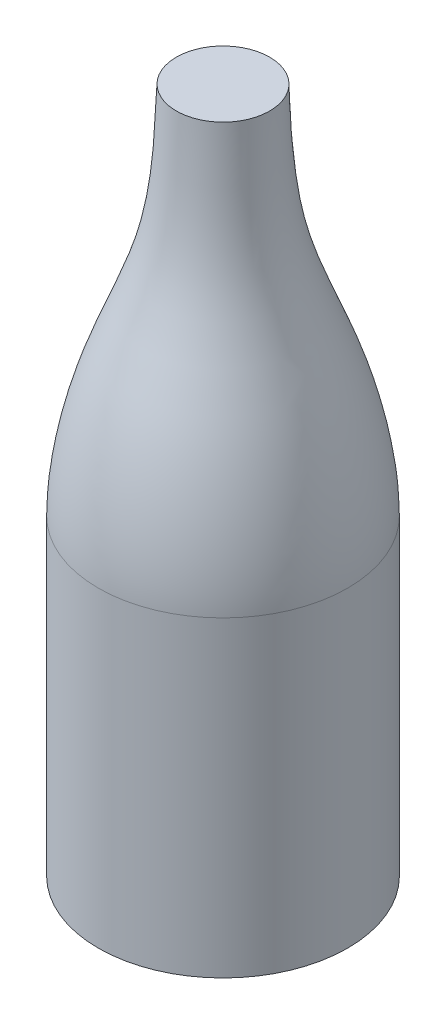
from build123d import *


with BuildPart() as part:
    # Sketch 1 → Revolve 1 (revolve)
    with BuildSketch(Plane.XY, mode=Mode.PRIVATE) as revolve_1_sk:
        with BuildLine():
            Line((0, 0), (20, 0))
            Line((20, 0), (20, 50))
            add(Edge.make_bspline(
                [(20, 50), (20, 56.276568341), (17.172206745, 70.561176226), (8.260977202, 88.908082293), (7.75469732, 102.649567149), (7.483884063, 110)],
                knots=[0, 0, 0, 0, 0.341056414, 0.647525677, 1, 1, 1, 1], degree=3))
            Line((7.483884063, 110), (0, 110))
            Line((0, 110), (0, 0))
        make_face()
    revolve(revolve_1_sk.sketch.rotate(Axis((0, 0, 0), (0, 1, 0)), 90), axis=Axis((0, 0, 0), (0, 1, 0)))


solid = part.part
